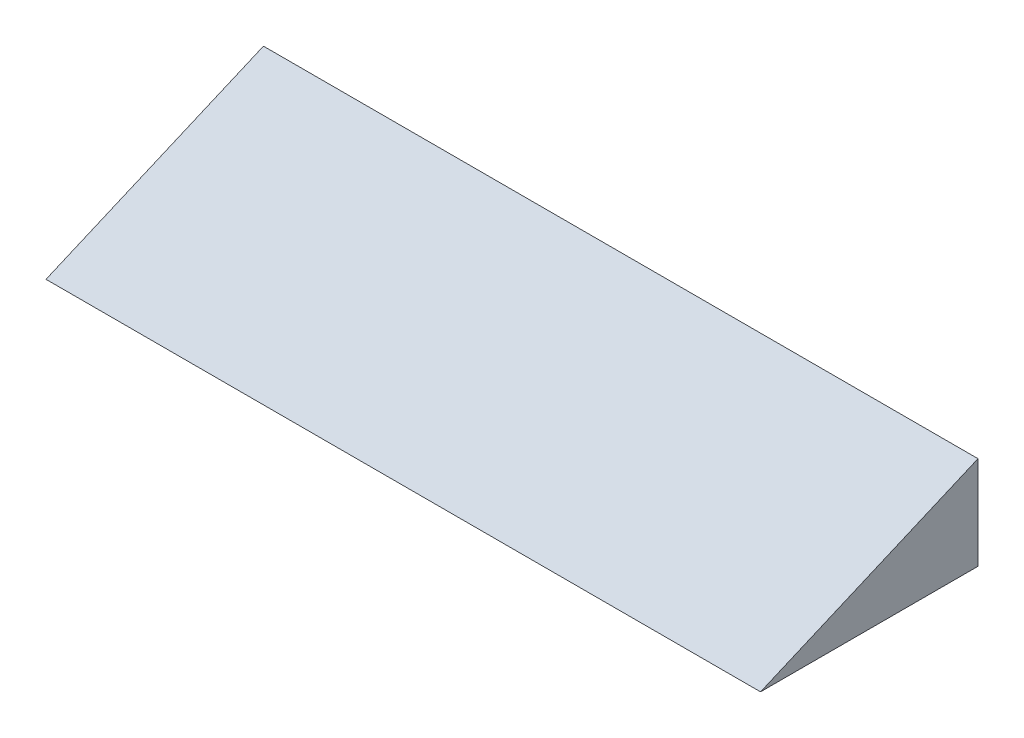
from build123d import *

# Parameters (mm, degrees)
EXTRUDE1_DEPTH = 292.1


with BuildPart() as part:
    # Sketch1 → Extrude1 (new body)
    with BuildSketch(Plane(origin=(0, 0, 0), x_dir=(0, 0, -1), z_dir=(1, 0, 0))):
        Polygon((0, 0), (0, 38.1), (-88.9, 0), align=None)
    extrude(amount=EXTRUDE1_DEPTH)


solid = part.part
